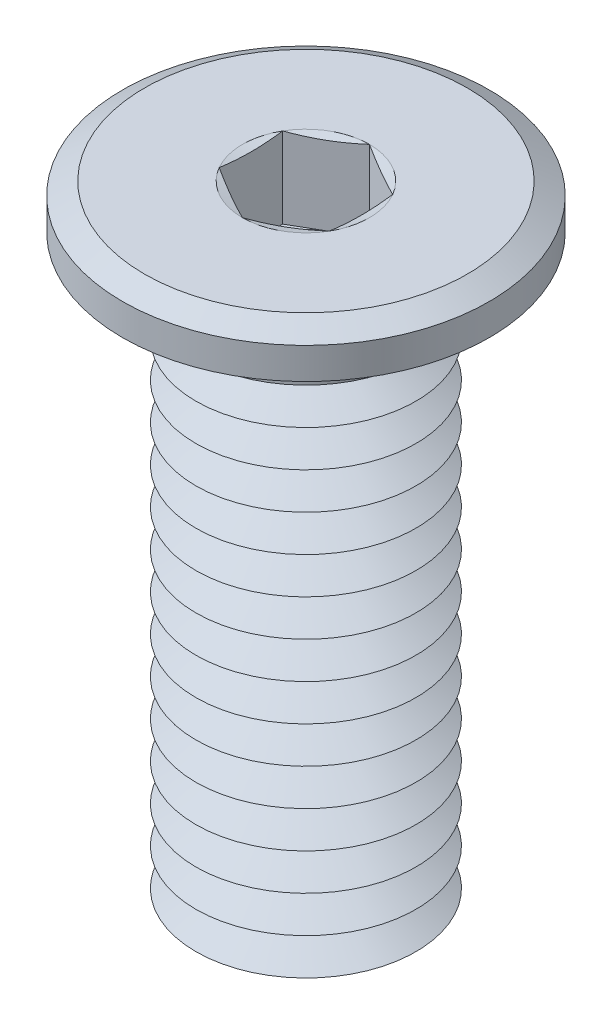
from build123d import *

# Parameters (mm, degrees)
SKETCH1_R           = 5
BOSS_EXTRUDE1_DEPTH = 1.2
SKETCH2_R           = 3
BOSS_EXTRUDE2_DEPTH = 16
LPATTERN1_COUNT     = 15
LPATTERN1_PITCH     = 1
FILLET1_R           = 0.25
CHAMFER2_SIZE       = 0.6
CHAMFER2_SIZE2      = 0.346410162
CUT_EXTRUDE1_DEPTH  = 2.2


with BuildPart() as part:
    # Sketch1 → Boss-Extrude1 (new body)
    with BuildSketch(Plane(origin=(0, 0, 0), x_dir=(1, 0, 0), z_dir=(0, 1, 0))):
        with Locations(Location((0, 0, 0), (0, 0, 270))):
            Circle(SKETCH1_R)
    extrude(amount=-BOSS_EXTRUDE1_DEPTH)

    # Sketch2 → Boss-Extrude2 (add)
    with BuildSketch(Plane.XZ.offset(1.2)):
        with Locations(Location((0, 0, 0), (0, 0, 270))):
            Circle(SKETCH2_R)
    extrude(amount=BOSS_EXTRUDE2_DEPTH)

    # Sketch5 → Cut-Revolve1 (revolve, cut)
    with BuildSketch(Plane(origin=(0, 0, 0), x_dir=(0, 0, -1), z_dir=(1, 0, 0))):
        Polygon((-3, -17.7), (-2.133974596, -17.2), (-3, -16.7), align=None)
    cut_revolve1 = revolve(axis=Axis((0, 0.990593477, 0), (0, -1, 0)), mode=Mode.SUBTRACT)

    # LPattern1: Cut-Revolve1 ×15
    with Locations(*[(0, i * LPATTERN1_PITCH, 0) for i in range(1, LPATTERN1_COUNT)]):
        add(cut_revolve1, mode=Mode.SUBTRACT)

    # Fillet1
    fillet1_edges = [part.edges().sort_by_distance(p)[0] for p in [
        (0, -1.2, 3),
    ]]
    fillet(fillet1_edges, radius=FILLET1_R)

    # Chamfer2
    chamfer2_edges = [part.edges().sort_by_distance(p)[0] for p in [
        (0, 0, -5),
    ]]
    chamfer2_side = [part.faces().sort_by_distance(p)[0] for p in [
        (0, 0, 0),
    ]]
    chamfer(chamfer2_edges, length=CHAMFER2_SIZE, length2=CHAMFER2_SIZE2, reference=chamfer2_side[0])

    # Sketch6 → Cut-Extrude1 (cut)
    with BuildSketch(Plane(origin=(0, 0, 0), x_dir=(1, 0, 0), z_dir=(0, 1, 0))):
        Polygon((0, 1.732050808), (-1.5, 0.866025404), (-1.5, -0.866025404), (0, -1.732050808), (1.5, -0.866025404), (1.5, 0.866025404), align=None)
    extrude(amount=-CUT_EXTRUDE1_DEPTH, mode=Mode.SUBTRACT)

    # Cut-Extrude2 cone 1 section (on through the dimple's axis) → Cut-Extrude2 (revolve, cut)
    with BuildSketch(Plane(origin=(0, -2.2, 0), x_dir=(0, 0, 1), z_dir=(1, 0, 0))):
        Polygon((0, 0), (1.5, 0), (0, 0.866025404), align=None)
    revolve(axis=Axis((0, -2.2, 0), (0, -1, 0)), mode=Mode.SUBTRACT)

    # Cut-Extrude3 cone 1 section (on through the dimple's axis) → Cut-Extrude3 (revolve, cut)
    with BuildSketch(Plane(origin=(0, 0, 0), x_dir=(0, 0, 1), z_dir=(1, 0, 0))):
        Polygon((0, 0), (1.732050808, 0), (0, 0.464101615), align=None)
    revolve(axis=Axis((0, 0, 0), (0, -1, 0)), mode=Mode.SUBTRACT)


solid = part.part
